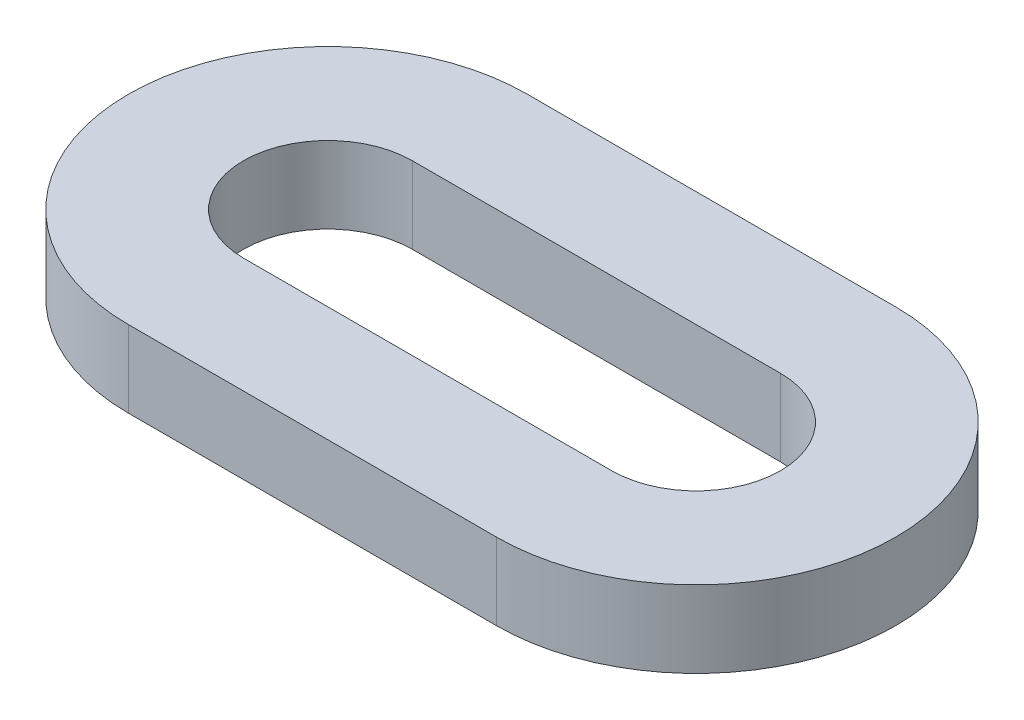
ISO-10303-21;
HEADER;
FILE_DESCRIPTION(('STEP AP214'),'2;1');
FILE_NAME('part.step','',(''),(''),'','','');
FILE_SCHEMA(('AUTOMOTIVE_DESIGN { 1 0 10303 214 1 1 1 1 }'));
ENDSEC;
DATA;
#1=APPLICATION_CONTEXT('core data for automotive mechanical design processes');
#2=APPLICATION_PROTOCOL_DEFINITION('international standard','automotive_design',2000,#1);
#3=PRODUCT_CONTEXT('',#1,'mechanical');
#4=PRODUCT('Part','Part','',(#3));
#5=PRODUCT_RELATED_PRODUCT_CATEGORY('part','',(#4));
#6=PRODUCT_DEFINITION_FORMATION('','',#4);
#7=PRODUCT_DEFINITION_CONTEXT('part definition',#1,'design');
#8=PRODUCT_DEFINITION('design','',#6,#7);
#9=PRODUCT_DEFINITION_SHAPE('','',#8);
#10=(LENGTH_UNIT() NAMED_UNIT(*) SI_UNIT(.MILLI.,.METRE.));
#11=(NAMED_UNIT(*) PLANE_ANGLE_UNIT() SI_UNIT($,.RADIAN.));
#12=(NAMED_UNIT(*) SI_UNIT($,.STERADIAN.) SOLID_ANGLE_UNIT());
#13=UNCERTAINTY_MEASURE_WITH_UNIT(LENGTH_MEASURE(1.E-05),#10,'distance_accuracy_value','');
#14=(GEOMETRIC_REPRESENTATION_CONTEXT(3) GLOBAL_UNCERTAINTY_ASSIGNED_CONTEXT((#13)) GLOBAL_UNIT_ASSIGNED_CONTEXT((#10,
#11,#12)) REPRESENTATION_CONTEXT('',''));
#15=CARTESIAN_POINT('',(0.,0.,0.));
#16=DIRECTION('',(0.,0.,1.));
#17=DIRECTION('',(1.,0.,0.));
#18=AXIS2_PLACEMENT_3D('',#15,#16,#17);
#19=CARTESIAN_POINT('',(-24.,10.,0.));
#20=DIRECTION('',(0.,-1.,0.));
#21=DIRECTION('',(0.,0.,-1.));
#22=AXIS2_PLACEMENT_3D('',#19,#20,#21);
#23=PLANE('',#22);
#24=CARTESIAN_POINT('',(-24.,10.,0.));
#25=DIRECTION('',(0.,1.,0.));
#26=DIRECTION('',(0.,0.,-1.));
#27=AXIS2_PLACEMENT_3D('',#24,#25,#26);
#28=CIRCLE('',#27,26.);
#29=CARTESIAN_POINT('',(-24.,10.,-26.));
#30=VERTEX_POINT('',#29);
#31=CARTESIAN_POINT('',(-24.,10.,26.));
#32=VERTEX_POINT('',#31);
#33=EDGE_CURVE('E132',#30,#32,#28,.T.);
#34=ORIENTED_EDGE('',*,*,#33,.T.);
#35=DIRECTION('',(1.,0.,0.));
#36=VECTOR('',#35,1.);
#37=CARTESIAN_POINT('',(24.,10.,26.));
#38=LINE('',#37,#36);
#39=CARTESIAN_POINT('',(24.,10.,26.));
#40=VERTEX_POINT('',#39);
#41=EDGE_CURVE('E135',#32,#40,#38,.T.);
#42=ORIENTED_EDGE('',*,*,#41,.T.);
#43=CARTESIAN_POINT('',(24.,10.,0.));
#44=DIRECTION('',(0.,1.,0.));
#45=DIRECTION('',(0.,0.,-1.));
#46=AXIS2_PLACEMENT_3D('',#43,#44,#45);
#47=CIRCLE('',#46,26.);
#48=CARTESIAN_POINT('',(24.,10.,-26.));
#49=VERTEX_POINT('',#48);
#50=EDGE_CURVE('E138',#40,#49,#47,.T.);
#51=ORIENTED_EDGE('',*,*,#50,.T.);
#52=DIRECTION('',(-1.,0.,0.));
#53=VECTOR('',#52,1.);
#54=CARTESIAN_POINT('',(-24.,10.,-26.));
#55=LINE('',#54,#53);
#56=EDGE_CURVE('E140',#49,#30,#55,.T.);
#57=ORIENTED_EDGE('',*,*,#56,.T.);
#58=EDGE_LOOP('',(#34,#42,#51,#57));
#59=FACE_BOUND('',#58,.T.);
#60=CARTESIAN_POINT('',(24.,10.,0.));
#61=DIRECTION('',(0.,1.,0.));
#62=DIRECTION('',(0.,0.,-1.));
#63=AXIS2_PLACEMENT_3D('',#60,#61,#62);
#64=CIRCLE('',#63,11.);
#65=CARTESIAN_POINT('',(24.,10.,11.));
#66=VERTEX_POINT('',#65);
#67=CARTESIAN_POINT('',(24.,10.,-11.));
#68=VERTEX_POINT('',#67);
#69=EDGE_CURVE('E96',#66,#68,#64,.T.);
#70=ORIENTED_EDGE('',*,*,#69,.F.);
#71=DIRECTION('',(1.,0.,0.));
#72=VECTOR('',#71,1.);
#73=CARTESIAN_POINT('',(24.,10.,11.));
#74=LINE('',#73,#72);
#75=CARTESIAN_POINT('',(-24.,10.,11.));
#76=VERTEX_POINT('',#75);
#77=EDGE_CURVE('E118',#76,#66,#74,.T.);
#78=ORIENTED_EDGE('',*,*,#77,.F.);
#79=CARTESIAN_POINT('',(-24.,10.,0.));
#80=DIRECTION('',(0.,1.,0.));
#81=DIRECTION('',(0.,0.,-1.));
#82=AXIS2_PLACEMENT_3D('',#79,#80,#81);
#83=CIRCLE('',#82,11.);
#84=CARTESIAN_POINT('',(-24.,10.,-11.));
#85=VERTEX_POINT('',#84);
#86=EDGE_CURVE('E116',#85,#76,#83,.T.);
#87=ORIENTED_EDGE('',*,*,#86,.F.);
#88=DIRECTION('',(-1.,0.,0.));
#89=VECTOR('',#88,1.);
#90=CARTESIAN_POINT('',(-24.,10.,-11.));
#91=LINE('',#90,#89);
#92=EDGE_CURVE('E104',#68,#85,#91,.T.);
#93=ORIENTED_EDGE('',*,*,#92,.F.);
#94=EDGE_LOOP('',(#70,#78,#87,#93));
#95=FACE_BOUND('',#94,.T.);
#96=ADVANCED_FACE('F31',(#59,#95),#23,.F.);
#97=CARTESIAN_POINT('',(-24.,0.,0.));
#98=DIRECTION('',(0.,-1.,0.));
#99=DIRECTION('',(0.,0.,-1.));
#100=AXIS2_PLACEMENT_3D('',#97,#98,#99);
#101=PLANE('',#100);
#102=CARTESIAN_POINT('',(-24.,0.,0.));
#103=DIRECTION('',(0.,1.,0.));
#104=DIRECTION('',(0.,0.,-1.));
#105=AXIS2_PLACEMENT_3D('',#102,#103,#104);
#106=CIRCLE('',#105,26.);
#107=CARTESIAN_POINT('',(-24.,0.,-26.));
#108=VERTEX_POINT('',#107);
#109=CARTESIAN_POINT('',(-24.,0.,26.));
#110=VERTEX_POINT('',#109);
#111=EDGE_CURVE('E112',#108,#110,#106,.T.);
#112=ORIENTED_EDGE('',*,*,#111,.F.);
#113=DIRECTION('',(-1.,0.,0.));
#114=VECTOR('',#113,1.);
#115=CARTESIAN_POINT('',(-24.,0.,-26.));
#116=LINE('',#115,#114);
#117=CARTESIAN_POINT('',(24.,0.,-26.));
#118=VERTEX_POINT('',#117);
#119=EDGE_CURVE('E136',#118,#108,#116,.T.);
#120=ORIENTED_EDGE('',*,*,#119,.F.);
#121=CARTESIAN_POINT('',(24.,0.,0.));
#122=DIRECTION('',(0.,1.,0.));
#123=DIRECTION('',(0.,0.,-1.));
#124=AXIS2_PLACEMENT_3D('',#121,#122,#123);
#125=CIRCLE('',#124,26.);
#126=CARTESIAN_POINT('',(24.,0.,26.));
#127=VERTEX_POINT('',#126);
#128=EDGE_CURVE('E147',#127,#118,#125,.T.);
#129=ORIENTED_EDGE('',*,*,#128,.F.);
#130=DIRECTION('',(1.,0.,0.));
#131=VECTOR('',#130,1.);
#132=CARTESIAN_POINT('',(24.,0.,26.));
#133=LINE('',#132,#131);
#134=EDGE_CURVE('E145',#110,#127,#133,.T.);
#135=ORIENTED_EDGE('',*,*,#134,.F.);
#136=EDGE_LOOP('',(#112,#120,#129,#135));
#137=FACE_BOUND('',#136,.T.);
#138=DIRECTION('',(1.,0.,0.));
#139=VECTOR('',#138,1.);
#140=CARTESIAN_POINT('',(24.,0.,11.));
#141=LINE('',#140,#139);
#142=CARTESIAN_POINT('',(-24.,0.,11.));
#143=VERTEX_POINT('',#142);
#144=CARTESIAN_POINT('',(24.,0.,11.));
#145=VERTEX_POINT('',#144);
#146=EDGE_CURVE('E105',#143,#145,#141,.T.);
#147=ORIENTED_EDGE('',*,*,#146,.T.);
#148=CARTESIAN_POINT('',(24.,0.,0.));
#149=DIRECTION('',(0.,1.,0.));
#150=DIRECTION('',(0.,0.,-1.));
#151=AXIS2_PLACEMENT_3D('',#148,#149,#150);
#152=CIRCLE('',#151,11.);
#153=CARTESIAN_POINT('',(24.,0.,-11.));
#154=VERTEX_POINT('',#153);
#155=EDGE_CURVE('E54',#145,#154,#152,.T.);
#156=ORIENTED_EDGE('',*,*,#155,.T.);
#157=DIRECTION('',(-1.,0.,0.));
#158=VECTOR('',#157,1.);
#159=CARTESIAN_POINT('',(-24.,0.,-11.));
#160=LINE('',#159,#158);
#161=CARTESIAN_POINT('',(-24.,0.,-11.));
#162=VERTEX_POINT('',#161);
#163=EDGE_CURVE('E111',#154,#162,#160,.T.);
#164=ORIENTED_EDGE('',*,*,#163,.T.);
#165=CARTESIAN_POINT('',(-24.,0.,0.));
#166=DIRECTION('',(0.,1.,0.));
#167=DIRECTION('',(0.,0.,-1.));
#168=AXIS2_PLACEMENT_3D('',#165,#166,#167);
#169=CIRCLE('',#168,11.);
#170=EDGE_CURVE('E124',#162,#143,#169,.T.);
#171=ORIENTED_EDGE('',*,*,#170,.T.);
#172=EDGE_LOOP('',(#147,#156,#164,#171));
#173=FACE_BOUND('',#172,.T.);
#174=ADVANCED_FACE('F165',(#137,#173),#101,.T.);
#175=CARTESIAN_POINT('',(-24.,10.,0.));
#176=DIRECTION('',(0.,-1.,0.));
#177=DIRECTION('',(0.,0.,-1.));
#178=AXIS2_PLACEMENT_3D('',#175,#176,#177);
#179=CYLINDRICAL_SURFACE('',#178,26.);
#180=ORIENTED_EDGE('',*,*,#111,.T.);
#181=DIRECTION('',(0.,-1.,0.));
#182=VECTOR('',#181,1.);
#183=CARTESIAN_POINT('',(-24.,10.,26.));
#184=LINE('',#183,#182);
#185=EDGE_CURVE('E11',#32,#110,#184,.T.);
#186=ORIENTED_EDGE('',*,*,#185,.F.);
#187=ORIENTED_EDGE('',*,*,#33,.F.);
#188=DIRECTION('',(0.,-1.,0.));
#189=VECTOR('',#188,1.);
#190=CARTESIAN_POINT('',(-24.,10.,-26.));
#191=LINE('',#190,#189);
#192=EDGE_CURVE('E142',#30,#108,#191,.T.);
#193=ORIENTED_EDGE('',*,*,#192,.T.);
#194=EDGE_LOOP('',(#180,#186,#187,#193));
#195=FACE_BOUND('',#194,.T.);
#196=ADVANCED_FACE('F33',(#195),#179,.T.);
#197=CARTESIAN_POINT('',(24.,10.,26.));
#198=DIRECTION('',(0.,0.,-1.));
#199=DIRECTION('',(-1.,0.,0.));
#200=AXIS2_PLACEMENT_3D('',#197,#198,#199);
#201=PLANE('',#200);
#202=ORIENTED_EDGE('',*,*,#134,.T.);
#203=DIRECTION('',(0.,-1.,0.));
#204=VECTOR('',#203,1.);
#205=CARTESIAN_POINT('',(24.,10.,26.));
#206=LINE('',#205,#204);
#207=EDGE_CURVE('E39',#40,#127,#206,.T.);
#208=ORIENTED_EDGE('',*,*,#207,.F.);
#209=ORIENTED_EDGE('',*,*,#41,.F.);
#210=ORIENTED_EDGE('',*,*,#185,.T.);
#211=EDGE_LOOP('',(#202,#208,#209,#210));
#212=FACE_BOUND('',#211,.T.);
#213=ADVANCED_FACE('F175',(#212),#201,.F.);
#214=CARTESIAN_POINT('',(24.,10.,0.));
#215=DIRECTION('',(0.,-1.,0.));
#216=DIRECTION('',(0.,0.,-1.));
#217=AXIS2_PLACEMENT_3D('',#214,#215,#216);
#218=CYLINDRICAL_SURFACE('',#217,26.);
#219=ORIENTED_EDGE('',*,*,#128,.T.);
#220=DIRECTION('',(0.,-1.,0.));
#221=VECTOR('',#220,1.);
#222=CARTESIAN_POINT('',(24.,10.,-26.));
#223=LINE('',#222,#221);
#224=EDGE_CURVE('E152',#49,#118,#223,.T.);
#225=ORIENTED_EDGE('',*,*,#224,.F.);
#226=ORIENTED_EDGE('',*,*,#50,.F.);
#227=ORIENTED_EDGE('',*,*,#207,.T.);
#228=EDGE_LOOP('',(#219,#225,#226,#227));
#229=FACE_BOUND('',#228,.T.);
#230=ADVANCED_FACE('F159',(#229),#218,.T.);
#231=CARTESIAN_POINT('',(-24.,10.,-26.));
#232=DIRECTION('',(0.,0.,1.));
#233=DIRECTION('',(1.,0.,0.));
#234=AXIS2_PLACEMENT_3D('',#231,#232,#233);
#235=PLANE('',#234);
#236=ORIENTED_EDGE('',*,*,#119,.T.);
#237=ORIENTED_EDGE('',*,*,#192,.F.);
#238=ORIENTED_EDGE('',*,*,#56,.F.);
#239=ORIENTED_EDGE('',*,*,#224,.T.);
#240=EDGE_LOOP('',(#236,#237,#238,#239));
#241=FACE_BOUND('',#240,.T.);
#242=ADVANCED_FACE('F169',(#241),#235,.F.);
#243=CARTESIAN_POINT('',(24.,10.,0.));
#244=DIRECTION('',(0.,-1.,0.));
#245=DIRECTION('',(0.,0.,-1.));
#246=AXIS2_PLACEMENT_3D('',#243,#244,#245);
#247=CYLINDRICAL_SURFACE('',#246,11.);
#248=ORIENTED_EDGE('',*,*,#155,.F.);
#249=DIRECTION('',(0.,-1.,0.));
#250=VECTOR('',#249,1.);
#251=CARTESIAN_POINT('',(24.,10.,11.));
#252=LINE('',#251,#250);
#253=EDGE_CURVE('E100',#66,#145,#252,.T.);
#254=ORIENTED_EDGE('',*,*,#253,.F.);
#255=ORIENTED_EDGE('',*,*,#69,.T.);
#256=DIRECTION('',(0.,-1.,0.));
#257=VECTOR('',#256,1.);
#258=CARTESIAN_POINT('',(24.,10.,-11.));
#259=LINE('',#258,#257);
#260=EDGE_CURVE('E99',#68,#154,#259,.T.);
#261=ORIENTED_EDGE('',*,*,#260,.T.);
#262=EDGE_LOOP('',(#248,#254,#255,#261));
#263=FACE_BOUND('',#262,.T.);
#264=ADVANCED_FACE('F98',(#263),#247,.F.);
#265=CARTESIAN_POINT('',(-24.,10.,-11.));
#266=DIRECTION('',(0.,0.,1.));
#267=DIRECTION('',(1.,0.,0.));
#268=AXIS2_PLACEMENT_3D('',#265,#266,#267);
#269=PLANE('',#268);
#270=ORIENTED_EDGE('',*,*,#163,.F.);
#271=ORIENTED_EDGE('',*,*,#260,.F.);
#272=ORIENTED_EDGE('',*,*,#92,.T.);
#273=DIRECTION('',(0.,-1.,0.));
#274=VECTOR('',#273,1.);
#275=CARTESIAN_POINT('',(-24.,10.,-11.));
#276=LINE('',#275,#274);
#277=EDGE_CURVE('E113',#85,#162,#276,.T.);
#278=ORIENTED_EDGE('',*,*,#277,.T.);
#279=EDGE_LOOP('',(#270,#271,#272,#278));
#280=FACE_BOUND('',#279,.T.);
#281=ADVANCED_FACE('F108',(#280),#269,.T.);
#282=CARTESIAN_POINT('',(-24.,10.,0.));
#283=DIRECTION('',(0.,-1.,0.));
#284=DIRECTION('',(0.,0.,-1.));
#285=AXIS2_PLACEMENT_3D('',#282,#283,#284);
#286=CYLINDRICAL_SURFACE('',#285,11.);
#287=ORIENTED_EDGE('',*,*,#170,.F.);
#288=ORIENTED_EDGE('',*,*,#277,.F.);
#289=ORIENTED_EDGE('',*,*,#86,.T.);
#290=DIRECTION('',(0.,-1.,0.));
#291=VECTOR('',#290,1.);
#292=CARTESIAN_POINT('',(-24.,10.,11.));
#293=LINE('',#292,#291);
#294=EDGE_CURVE('E46',#76,#143,#293,.T.);
#295=ORIENTED_EDGE('',*,*,#294,.T.);
#296=EDGE_LOOP('',(#287,#288,#289,#295));
#297=FACE_BOUND('',#296,.T.);
#298=ADVANCED_FACE('F198',(#297),#286,.F.);
#299=CARTESIAN_POINT('',(24.,10.,11.));
#300=DIRECTION('',(0.,0.,-1.));
#301=DIRECTION('',(-1.,0.,0.));
#302=AXIS2_PLACEMENT_3D('',#299,#300,#301);
#303=PLANE('',#302);
#304=ORIENTED_EDGE('',*,*,#146,.F.);
#305=ORIENTED_EDGE('',*,*,#294,.F.);
#306=ORIENTED_EDGE('',*,*,#77,.T.);
#307=ORIENTED_EDGE('',*,*,#253,.T.);
#308=EDGE_LOOP('',(#304,#305,#306,#307));
#309=FACE_BOUND('',#308,.T.);
#310=ADVANCED_FACE('F202',(#309),#303,.T.);
#311=CLOSED_SHELL('',(#96,#174,#196,#213,#230,#242,#264,#281,#298,#310));
#312=MANIFOLD_SOLID_BREP('B2',#311);
#313=ADVANCED_BREP_SHAPE_REPRESENTATION('',(#18,#312),#14);
#314=SHAPE_DEFINITION_REPRESENTATION(#9,#313);
ENDSEC;
END-ISO-10303-21;
